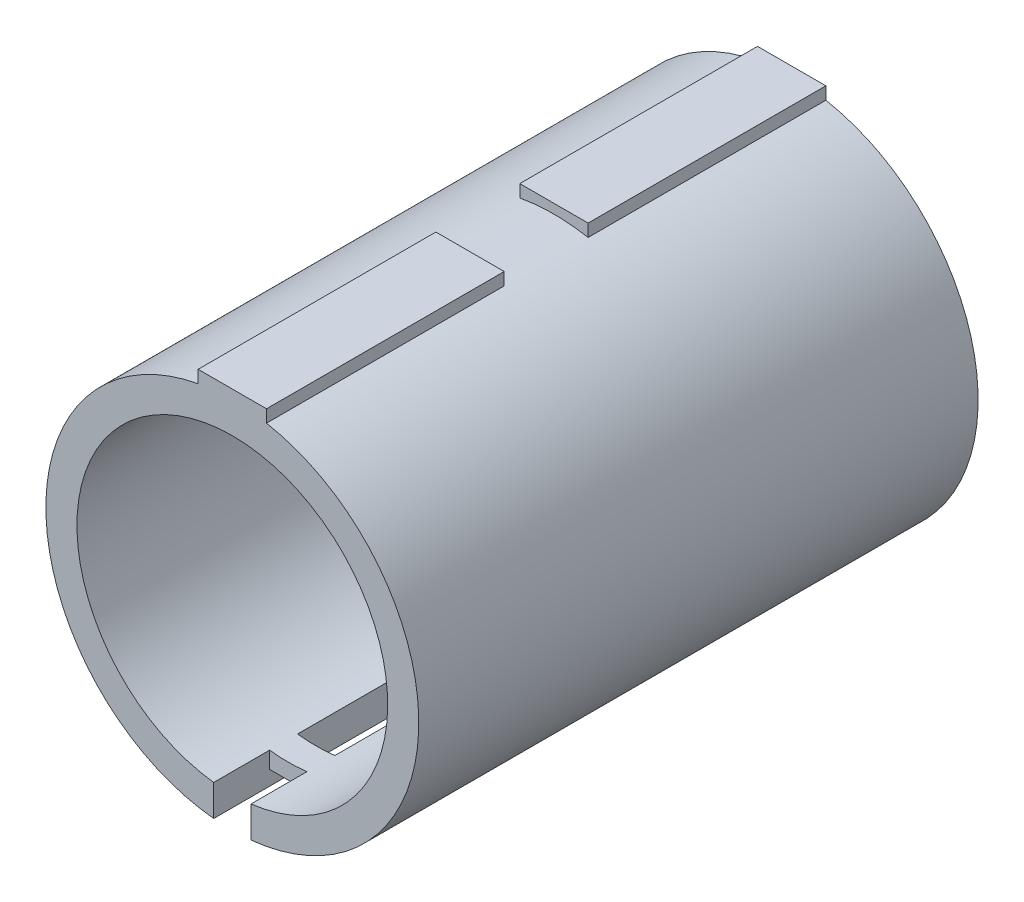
ISO-10303-21;
HEADER;
FILE_DESCRIPTION(('STEP AP214'),'2;1');
FILE_NAME('part.step','',(''),(''),'','','');
FILE_SCHEMA(('AUTOMOTIVE_DESIGN { 1 0 10303 214 1 1 1 1 }'));
ENDSEC;
DATA;
#1=APPLICATION_CONTEXT('core data for automotive mechanical design processes');
#2=APPLICATION_PROTOCOL_DEFINITION('international standard','automotive_design',2000,#1);
#3=PRODUCT_CONTEXT('',#1,'mechanical');
#4=PRODUCT('Part','Part','',(#3));
#5=PRODUCT_RELATED_PRODUCT_CATEGORY('part','',(#4));
#6=PRODUCT_DEFINITION_FORMATION('','',#4);
#7=PRODUCT_DEFINITION_CONTEXT('part definition',#1,'design');
#8=PRODUCT_DEFINITION('design','',#6,#7);
#9=PRODUCT_DEFINITION_SHAPE('','',#8);
#10=(LENGTH_UNIT() NAMED_UNIT(*) SI_UNIT(.MILLI.,.METRE.));
#11=(NAMED_UNIT(*) PLANE_ANGLE_UNIT() SI_UNIT($,.RADIAN.));
#12=(NAMED_UNIT(*) SI_UNIT($,.STERADIAN.) SOLID_ANGLE_UNIT());
#13=UNCERTAINTY_MEASURE_WITH_UNIT(LENGTH_MEASURE(1.E-05),#10,'distance_accuracy_value','');
#14=(GEOMETRIC_REPRESENTATION_CONTEXT(3) GLOBAL_UNCERTAINTY_ASSIGNED_CONTEXT((#13)) GLOBAL_UNIT_ASSIGNED_CONTEXT((#10,
#11,#12)) REPRESENTATION_CONTEXT('',''));
#15=CARTESIAN_POINT('',(0.,0.,0.));
#16=DIRECTION('',(0.,0.,1.));
#17=DIRECTION('',(1.,0.,0.));
#18=AXIS2_PLACEMENT_3D('',#15,#16,#17);
#19=CARTESIAN_POINT('',(3.29597460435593E-13,0.,22.5));
#20=DIRECTION('',(0.,0.,-1.));
#21=DIRECTION('',(0.,1.,0.));
#22=AXIS2_PLACEMENT_3D('',#19,#20,#21);
#23=CYLINDRICAL_SURFACE('',#22,14.9999999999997);
#24=DIRECTION('',(0.,0.,-1.));
#25=VECTOR('',#24,1.);
#26=CARTESIAN_POINT('',(2.75,14.7457621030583,22.5));
#27=LINE('',#26,#25);
#28=CARTESIAN_POINT('',(2.75,14.7457621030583,-3.375));
#29=VERTEX_POINT('',#28);
#30=CARTESIAN_POINT('',(2.75,14.7457621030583,-22.5));
#31=VERTEX_POINT('',#30);
#32=EDGE_CURVE('E184',#29,#31,#27,.T.);
#33=ORIENTED_EDGE('',*,*,#32,.F.);
#34=CARTESIAN_POINT('',(3.29597460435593E-13,0.,-3.375));
#35=DIRECTION('',(0.,0.,1.));
#36=DIRECTION('',(0.0999999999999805,0.994987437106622,0.));
#37=AXIS2_PLACEMENT_3D('',#34,#35,#36);
#38=CIRCLE('',#37,14.9999999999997);
#39=CARTESIAN_POINT('',(-2.75,14.7457621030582,-3.375));
#40=VERTEX_POINT('',#39);
#41=EDGE_CURVE('E32',#29,#40,#38,.T.);
#42=ORIENTED_EDGE('',*,*,#41,.T.);
#43=DIRECTION('',(0.,0.,-1.));
#44=VECTOR('',#43,1.);
#45=CARTESIAN_POINT('',(-2.75,14.7457621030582,22.5));
#46=LINE('',#45,#44);
#47=CARTESIAN_POINT('',(-2.75,14.7457621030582,-22.5));
#48=VERTEX_POINT('',#47);
#49=EDGE_CURVE('E180',#40,#48,#46,.T.);
#50=ORIENTED_EDGE('',*,*,#49,.T.);
#51=CARTESIAN_POINT('',(3.29597460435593E-13,0.,-22.5));
#52=DIRECTION('',(0.,0.,1.));
#53=DIRECTION('',(-0.100000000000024,0.994987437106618,0.));
#54=AXIS2_PLACEMENT_3D('',#51,#52,#53);
#55=CIRCLE('',#54,14.9999999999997);
#56=CARTESIAN_POINT('',(-1.5,-14.9248115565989,-22.5));
#57=VERTEX_POINT('',#56);
#58=EDGE_CURVE('E18',#48,#57,#55,.T.);
#59=ORIENTED_EDGE('',*,*,#58,.T.);
#60=DIRECTION('',(0.,0.,-1.));
#61=VECTOR('',#60,1.);
#62=CARTESIAN_POINT('',(-1.5,-14.924811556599,22.5));
#63=LINE('',#62,#61);
#64=CARTESIAN_POINT('',(-1.5,-14.924811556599,22.5));
#65=VERTEX_POINT('',#64);
#66=EDGE_CURVE('E248',#65,#57,#63,.T.);
#67=ORIENTED_EDGE('',*,*,#66,.F.);
#68=CARTESIAN_POINT('',(3.29597460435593E-13,0.,22.5));
#69=DIRECTION('',(0.,0.,-1.));
#70=DIRECTION('',(-0.100000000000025,-0.994987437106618,0.));
#71=AXIS2_PLACEMENT_3D('',#68,#69,#70);
#72=CIRCLE('',#71,14.9999999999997);
#73=CARTESIAN_POINT('',(-2.75,14.7457621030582,22.5));
#74=VERTEX_POINT('',#73);
#75=EDGE_CURVE('E345',#74,#65,#72,.F.);
#76=ORIENTED_EDGE('',*,*,#75,.F.);
#77=DIRECTION('',(0.,0.,-1.));
#78=VECTOR('',#77,1.);
#79=CARTESIAN_POINT('',(-2.75,14.7457621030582,22.5));
#80=LINE('',#79,#78);
#81=CARTESIAN_POINT('',(-2.75,14.7457621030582,3.375));
#82=VERTEX_POINT('',#81);
#83=EDGE_CURVE('E197',#74,#82,#80,.T.);
#84=ORIENTED_EDGE('',*,*,#83,.T.);
#85=CARTESIAN_POINT('',(3.29597460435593E-13,0.,3.375));
#86=DIRECTION('',(0.,0.,-1.));
#87=DIRECTION('',(-0.100000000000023,0.994987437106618,0.));
#88=AXIS2_PLACEMENT_3D('',#85,#86,#87);
#89=CIRCLE('',#88,14.9999999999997);
#90=CARTESIAN_POINT('',(2.75,14.7457621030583,3.375));
#91=VERTEX_POINT('',#90);
#92=EDGE_CURVE('E343',#91,#82,#89,.F.);
#93=ORIENTED_EDGE('',*,*,#92,.F.);
#94=DIRECTION('',(0.,0.,-1.));
#95=VECTOR('',#94,1.);
#96=CARTESIAN_POINT('',(2.75,14.7457621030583,22.5));
#97=LINE('',#96,#95);
#98=CARTESIAN_POINT('',(2.75,14.7457621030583,22.5));
#99=VERTEX_POINT('',#98);
#100=EDGE_CURVE('E161',#99,#91,#97,.T.);
#101=ORIENTED_EDGE('',*,*,#100,.F.);
#102=CARTESIAN_POINT('',(3.29597460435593E-13,0.,22.5));
#103=DIRECTION('',(0.,0.,-1.));
#104=DIRECTION('',(0.0999999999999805,0.994987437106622,0.));
#105=AXIS2_PLACEMENT_3D('',#102,#103,#104);
#106=CIRCLE('',#105,14.9999999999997);
#107=CARTESIAN_POINT('',(1.5,-14.924811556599,22.5));
#108=VERTEX_POINT('',#107);
#109=EDGE_CURVE('E326',#108,#99,#106,.F.);
#110=ORIENTED_EDGE('',*,*,#109,.F.);
#111=DIRECTION('',(0.,0.,1.));
#112=VECTOR('',#111,1.);
#113=CARTESIAN_POINT('',(1.5,-14.924811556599,-22.5));
#114=LINE('',#113,#112);
#115=CARTESIAN_POINT('',(1.5,-14.924811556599,-22.5));
#116=VERTEX_POINT('',#115);
#117=EDGE_CURVE('E297',#108,#116,#114,.F.);
#118=ORIENTED_EDGE('',*,*,#117,.T.);
#119=CARTESIAN_POINT('',(3.29597460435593E-13,0.,-22.5));
#120=DIRECTION('',(0.,0.,1.));
#121=DIRECTION('',(0.09999999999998,-0.994987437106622,0.));
#122=AXIS2_PLACEMENT_3D('',#119,#120,#121);
#123=CIRCLE('',#122,14.9999999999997);
#124=EDGE_CURVE('E331',#116,#31,#123,.T.);
#125=ORIENTED_EDGE('',*,*,#124,.T.);
#126=EDGE_LOOP('',(#33,#42,#50,#59,#67,#76,#84,#93,#101,#110,#118,#125));
#127=FACE_BOUND('',#126,.T.);
#128=ADVANCED_FACE('F14',(#127),#23,.T.);
#129=CARTESIAN_POINT('',(-1.5,15.75,-3.375));
#130=DIRECTION('',(0.,1.,0.));
#131=DIRECTION('',(1.,0.,0.));
#132=AXIS2_PLACEMENT_3D('',#129,#130,#131);
#133=PLANE('',#132);
#134=DIRECTION('',(1.,0.,0.));
#135=VECTOR('',#134,1.);
#136=CARTESIAN_POINT('',(-1.5,15.75,-3.375));
#137=LINE('',#136,#135);
#138=CARTESIAN_POINT('',(2.75,15.75,-3.375));
#139=VERTEX_POINT('',#138);
#140=CARTESIAN_POINT('',(-2.75,15.75,-3.375));
#141=VERTEX_POINT('',#140);
#142=EDGE_CURVE('E153',#139,#141,#137,.F.);
#143=ORIENTED_EDGE('',*,*,#142,.F.);
#144=DIRECTION('',(0.,0.,1.));
#145=VECTOR('',#144,1.);
#146=CARTESIAN_POINT('',(2.75,15.75,-3.375));
#147=LINE('',#146,#145);
#148=CARTESIAN_POINT('',(2.75,15.75,-22.5));
#149=VERTEX_POINT('',#148);
#150=EDGE_CURVE('E156',#149,#139,#147,.T.);
#151=ORIENTED_EDGE('',*,*,#150,.F.);
#152=DIRECTION('',(-1.,0.,0.));
#153=VECTOR('',#152,1.);
#154=CARTESIAN_POINT('',(1.5,15.75,-22.5));
#155=LINE('',#154,#153);
#156=CARTESIAN_POINT('',(-2.75,15.75,-22.5));
#157=VERTEX_POINT('',#156);
#158=EDGE_CURVE('E160',#149,#157,#155,.T.);
#159=ORIENTED_EDGE('',*,*,#158,.T.);
#160=DIRECTION('',(0.,0.,1.));
#161=VECTOR('',#160,1.);
#162=CARTESIAN_POINT('',(-2.75,15.75,-3.375));
#163=LINE('',#162,#161);
#164=EDGE_CURVE('E158',#157,#141,#163,.T.);
#165=ORIENTED_EDGE('',*,*,#164,.T.);
#166=EDGE_LOOP('',(#143,#151,#159,#165));
#167=FACE_BOUND('',#166,.T.);
#168=ADVANCED_FACE('F154',(#167),#133,.T.);
#169=CARTESIAN_POINT('',(-1.5,-14.924811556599,-22.5));
#170=DIRECTION('',(1.,0.,0.));
#171=DIRECTION('',(0.,1.,0.));
#172=AXIS2_PLACEMENT_3D('',#169,#170,#171);
#173=PLANE('',#172);
#174=DIRECTION('',(0.,0.,1.));
#175=VECTOR('',#174,1.);
#176=CARTESIAN_POINT('',(-1.5,-13.75,-18.));
#177=LINE('',#176,#175);
#178=CARTESIAN_POINT('',(-1.5,-13.75,-15.75));
#179=VERTEX_POINT('',#178);
#180=CARTESIAN_POINT('',(-1.5,-13.75,-18.));
#181=VERTEX_POINT('',#180);
#182=EDGE_CURVE('E212',#179,#181,#177,.F.);
#183=ORIENTED_EDGE('',*,*,#182,.F.);
#184=DIRECTION('',(0.,1.,0.));
#185=VECTOR('',#184,1.);
#186=CARTESIAN_POINT('',(-1.5,-13.75,-15.75));
#187=LINE('',#186,#185);
#188=CARTESIAN_POINT('',(-1.5,-12.409673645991,-15.75));
#189=VERTEX_POINT('',#188);
#190=EDGE_CURVE('E217',#189,#179,#187,.F.);
#191=ORIENTED_EDGE('',*,*,#190,.F.);
#192=DIRECTION('',(0.,0.,1.));
#193=VECTOR('',#192,1.);
#194=CARTESIAN_POINT('',(-1.5,-12.409673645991,-15.75));
#195=LINE('',#194,#193);
#196=CARTESIAN_POINT('',(-1.5,-12.4096736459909,15.75));
#197=VERTEX_POINT('',#196);
#198=EDGE_CURVE('E221',#197,#189,#195,.F.);
#199=ORIENTED_EDGE('',*,*,#198,.F.);
#200=DIRECTION('',(0.,-1.,0.));
#201=VECTOR('',#200,1.);
#202=CARTESIAN_POINT('',(-1.5,-12.4096736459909,15.75));
#203=LINE('',#202,#201);
#204=CARTESIAN_POINT('',(-1.5,-13.75,15.75));
#205=VERTEX_POINT('',#204);
#206=EDGE_CURVE('E225',#197,#205,#203,.T.);
#207=ORIENTED_EDGE('',*,*,#206,.T.);
#208=DIRECTION('',(0.,0.,1.));
#209=VECTOR('',#208,1.);
#210=CARTESIAN_POINT('',(-1.5,-13.75,15.75));
#211=LINE('',#210,#209);
#212=CARTESIAN_POINT('',(-1.5,-13.75,18.));
#213=VERTEX_POINT('',#212);
#214=EDGE_CURVE('E230',#205,#213,#211,.T.);
#215=ORIENTED_EDGE('',*,*,#214,.T.);
#216=DIRECTION('',(0.,1.,0.));
#217=VECTOR('',#216,1.);
#218=CARTESIAN_POINT('',(-1.5,-13.75,18.));
#219=LINE('',#218,#217);
#220=CARTESIAN_POINT('',(-1.5,-12.409673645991,18.));
#221=VERTEX_POINT('',#220);
#222=EDGE_CURVE('E235',#221,#213,#219,.F.);
#223=ORIENTED_EDGE('',*,*,#222,.F.);
#224=DIRECTION('',(0.,0.,1.));
#225=VECTOR('',#224,1.);
#226=CARTESIAN_POINT('',(-1.5,-12.409673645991,18.));
#227=LINE('',#226,#225);
#228=CARTESIAN_POINT('',(-1.5,-12.4096736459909,22.5));
#229=VERTEX_POINT('',#228);
#230=EDGE_CURVE('E239',#229,#221,#227,.F.);
#231=ORIENTED_EDGE('',*,*,#230,.F.);
#232=DIRECTION('',(0.,-1.,0.));
#233=VECTOR('',#232,1.);
#234=CARTESIAN_POINT('',(-1.5,-12.4096736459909,22.5));
#235=LINE('',#234,#233);
#236=EDGE_CURVE('E243',#65,#229,#235,.F.);
#237=ORIENTED_EDGE('',*,*,#236,.F.);
#238=ORIENTED_EDGE('',*,*,#66,.T.);
#239=DIRECTION('',(0.,1.,0.));
#240=VECTOR('',#239,1.);
#241=CARTESIAN_POINT('',(-1.5,-14.9248115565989,-22.5));
#242=LINE('',#241,#240);
#243=CARTESIAN_POINT('',(-1.5,-12.409673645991,-22.5));
#244=VERTEX_POINT('',#243);
#245=EDGE_CURVE('E253',#57,#244,#242,.T.);
#246=ORIENTED_EDGE('',*,*,#245,.T.);
#247=DIRECTION('',(0.,0.,1.));
#248=VECTOR('',#247,1.);
#249=CARTESIAN_POINT('',(-1.5,-12.409673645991,-22.5));
#250=LINE('',#249,#248);
#251=CARTESIAN_POINT('',(-1.5,-12.4096736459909,-18.));
#252=VERTEX_POINT('',#251);
#253=EDGE_CURVE('E258',#252,#244,#250,.F.);
#254=ORIENTED_EDGE('',*,*,#253,.F.);
#255=DIRECTION('',(0.,-1.,0.));
#256=VECTOR('',#255,1.);
#257=CARTESIAN_POINT('',(-1.5,-12.4096736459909,-18.));
#258=LINE('',#257,#256);
#259=EDGE_CURVE('E262',#252,#181,#258,.T.);
#260=ORIENTED_EDGE('',*,*,#259,.T.);
#261=EDGE_LOOP('',(#183,#191,#199,#207,#215,#223,#231,#237,#238,#246,#254,#260));
#262=FACE_BOUND('',#261,.T.);
#263=ADVANCED_FACE('F415',(#262),#173,.T.);
#264=CARTESIAN_POINT('',(1.5,-14.924811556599,22.5));
#265=DIRECTION('',(-1.,0.,0.));
#266=DIRECTION('',(0.,1.,0.));
#267=AXIS2_PLACEMENT_3D('',#264,#265,#266);
#268=PLANE('',#267);
#269=DIRECTION('',(0.,0.,-1.));
#270=VECTOR('',#269,1.);
#271=CARTESIAN_POINT('',(1.5,-12.409673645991,15.75));
#272=LINE('',#271,#270);
#273=CARTESIAN_POINT('',(1.5,-12.409673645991,15.75));
#274=VERTEX_POINT('',#273);
#275=CARTESIAN_POINT('',(1.5,-12.4096736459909,-15.75));
#276=VERTEX_POINT('',#275);
#277=EDGE_CURVE('E267',#274,#276,#272,.T.);
#278=ORIENTED_EDGE('',*,*,#277,.T.);
#279=DIRECTION('',(0.,-1.,0.));
#280=VECTOR('',#279,1.);
#281=CARTESIAN_POINT('',(1.5,-12.4096736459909,-15.75));
#282=LINE('',#281,#280);
#283=CARTESIAN_POINT('',(1.5,-13.75,-15.75));
#284=VERTEX_POINT('',#283);
#285=EDGE_CURVE('E272',#284,#276,#282,.F.);
#286=ORIENTED_EDGE('',*,*,#285,.F.);
#287=DIRECTION('',(0.,0.,-1.));
#288=VECTOR('',#287,1.);
#289=CARTESIAN_POINT('',(1.5,-13.75,-15.75));
#290=LINE('',#289,#288);
#291=CARTESIAN_POINT('',(1.5,-13.75,-18.));
#292=VERTEX_POINT('',#291);
#293=EDGE_CURVE('E277',#284,#292,#290,.T.);
#294=ORIENTED_EDGE('',*,*,#293,.T.);
#295=DIRECTION('',(0.,1.,0.));
#296=VECTOR('',#295,1.);
#297=CARTESIAN_POINT('',(1.5,-13.75,-18.));
#298=LINE('',#297,#296);
#299=CARTESIAN_POINT('',(1.5,-12.409673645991,-18.));
#300=VERTEX_POINT('',#299);
#301=EDGE_CURVE('E282',#292,#300,#298,.T.);
#302=ORIENTED_EDGE('',*,*,#301,.T.);
#303=DIRECTION('',(0.,0.,-1.));
#304=VECTOR('',#303,1.);
#305=CARTESIAN_POINT('',(1.5,-12.409673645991,-18.));
#306=LINE('',#305,#304);
#307=CARTESIAN_POINT('',(1.5,-12.4096736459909,-22.5));
#308=VERTEX_POINT('',#307);
#309=EDGE_CURVE('E287',#300,#308,#306,.T.);
#310=ORIENTED_EDGE('',*,*,#309,.T.);
#311=DIRECTION('',(0.,-1.,0.));
#312=VECTOR('',#311,1.);
#313=CARTESIAN_POINT('',(1.5,-12.4096736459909,-22.5));
#314=LINE('',#313,#312);
#315=EDGE_CURVE('E292',#308,#116,#314,.T.);
#316=ORIENTED_EDGE('',*,*,#315,.T.);
#317=ORIENTED_EDGE('',*,*,#117,.F.);
#318=DIRECTION('',(0.,1.,0.));
#319=VECTOR('',#318,1.);
#320=CARTESIAN_POINT('',(1.5,-14.924811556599,22.5));
#321=LINE('',#320,#319);
#322=CARTESIAN_POINT('',(1.5,-12.409673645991,22.5));
#323=VERTEX_POINT('',#322);
#324=EDGE_CURVE('E302',#323,#108,#321,.F.);
#325=ORIENTED_EDGE('',*,*,#324,.F.);
#326=DIRECTION('',(0.,0.,-1.));
#327=VECTOR('',#326,1.);
#328=CARTESIAN_POINT('',(1.5,-12.409673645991,22.5));
#329=LINE('',#328,#327);
#330=CARTESIAN_POINT('',(1.5,-12.4096736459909,18.));
#331=VERTEX_POINT('',#330);
#332=EDGE_CURVE('E306',#323,#331,#329,.T.);
#333=ORIENTED_EDGE('',*,*,#332,.T.);
#334=DIRECTION('',(0.,-1.,0.));
#335=VECTOR('',#334,1.);
#336=CARTESIAN_POINT('',(1.5,-12.4096736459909,18.));
#337=LINE('',#336,#335);
#338=CARTESIAN_POINT('',(1.5,-13.75,18.));
#339=VERTEX_POINT('',#338);
#340=EDGE_CURVE('E311',#339,#331,#337,.F.);
#341=ORIENTED_EDGE('',*,*,#340,.F.);
#342=DIRECTION('',(0.,0.,-1.));
#343=VECTOR('',#342,1.);
#344=CARTESIAN_POINT('',(1.5,-13.75,18.));
#345=LINE('',#344,#343);
#346=CARTESIAN_POINT('',(1.5,-13.75,15.75));
#347=VERTEX_POINT('',#346);
#348=EDGE_CURVE('E316',#347,#339,#345,.F.);
#349=ORIENTED_EDGE('',*,*,#348,.F.);
#350=DIRECTION('',(0.,1.,0.));
#351=VECTOR('',#350,1.);
#352=CARTESIAN_POINT('',(1.5,-13.75,15.75));
#353=LINE('',#352,#351);
#354=EDGE_CURVE('E321',#347,#274,#353,.T.);
#355=ORIENTED_EDGE('',*,*,#354,.T.);
#356=EDGE_LOOP('',(#278,#286,#294,#302,#310,#316,#317,#325,#333,#341,#349,#355));
#357=FACE_BOUND('',#356,.T.);
#358=ADVANCED_FACE('F425',(#357),#268,.T.);
#359=CARTESIAN_POINT('',(-1.5,15.75,22.5));
#360=DIRECTION('',(0.,1.,0.));
#361=DIRECTION('',(1.,0.,0.));
#362=AXIS2_PLACEMENT_3D('',#359,#360,#361);
#363=PLANE('',#362);
#364=DIRECTION('',(1.,0.,0.));
#365=VECTOR('',#364,1.);
#366=CARTESIAN_POINT('',(-1.5,15.75,22.5));
#367=LINE('',#366,#365);
#368=CARTESIAN_POINT('',(2.75,15.75,22.5));
#369=VERTEX_POINT('',#368);
#370=CARTESIAN_POINT('',(-2.75,15.75,22.5));
#371=VERTEX_POINT('',#370);
#372=EDGE_CURVE('E388',#369,#371,#367,.F.);
#373=ORIENTED_EDGE('',*,*,#372,.F.);
#374=DIRECTION('',(0.,0.,1.));
#375=VECTOR('',#374,1.);
#376=CARTESIAN_POINT('',(2.75,15.75,22.5));
#377=LINE('',#376,#375);
#378=CARTESIAN_POINT('',(2.75,15.75,3.375));
#379=VERTEX_POINT('',#378);
#380=EDGE_CURVE('E187',#379,#369,#377,.T.);
#381=ORIENTED_EDGE('',*,*,#380,.F.);
#382=DIRECTION('',(-1.,0.,0.));
#383=VECTOR('',#382,1.);
#384=CARTESIAN_POINT('',(1.5,15.75,3.375));
#385=LINE('',#384,#383);
#386=CARTESIAN_POINT('',(-2.75,15.75,3.375));
#387=VERTEX_POINT('',#386);
#388=EDGE_CURVE('E392',#379,#387,#385,.T.);
#389=ORIENTED_EDGE('',*,*,#388,.T.);
#390=DIRECTION('',(0.,0.,1.));
#391=VECTOR('',#390,1.);
#392=CARTESIAN_POINT('',(-2.75,15.75,22.5));
#393=LINE('',#392,#391);
#394=EDGE_CURVE('E186',#387,#371,#393,.T.);
#395=ORIENTED_EDGE('',*,*,#394,.T.);
#396=EDGE_LOOP('',(#373,#381,#389,#395));
#397=FACE_BOUND('',#396,.T.);
#398=ADVANCED_FACE('F459',(#397),#363,.T.);
#399=CARTESIAN_POINT('',(-15.3290676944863,-14.924811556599,22.5));
#400=DIRECTION('',(0.,0.,1.));
#401=DIRECTION('',(1.,0.,0.));
#402=AXIS2_PLACEMENT_3D('',#399,#400,#401);
#403=PLANE('',#402);
#404=ORIENTED_EDGE('',*,*,#109,.T.);
#405=DIRECTION('',(0.,-1.,0.));
#406=VECTOR('',#405,1.);
#407=CARTESIAN_POINT('',(2.75,14.2499999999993,22.5));
#408=LINE('',#407,#406);
#409=EDGE_CURVE('E190',#369,#99,#408,.T.);
#410=ORIENTED_EDGE('',*,*,#409,.F.);
#411=ORIENTED_EDGE('',*,*,#372,.T.);
#412=DIRECTION('',(0.,-1.,0.));
#413=VECTOR('',#412,1.);
#414=CARTESIAN_POINT('',(-2.75,14.2499999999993,22.5));
#415=LINE('',#414,#413);
#416=EDGE_CURVE('E200',#371,#74,#415,.T.);
#417=ORIENTED_EDGE('',*,*,#416,.T.);
#418=ORIENTED_EDGE('',*,*,#75,.T.);
#419=ORIENTED_EDGE('',*,*,#236,.T.);
#420=CARTESIAN_POINT('',(0.,0.,22.5));
#421=DIRECTION('',(0.,0.,-1.));
#422=DIRECTION('',(1.,0.,0.));
#423=AXIS2_PLACEMENT_3D('',#420,#421,#422);
#424=CIRCLE('',#423,12.5);
#425=EDGE_CURVE('E384',#323,#229,#424,.F.);
#426=ORIENTED_EDGE('',*,*,#425,.F.);
#427=ORIENTED_EDGE('',*,*,#324,.T.);
#428=EDGE_LOOP('',(#404,#410,#411,#417,#418,#419,#426,#427));
#429=FACE_BOUND('',#428,.T.);
#430=ADVANCED_FACE('F410',(#429),#403,.T.);
#431=CARTESIAN_POINT('',(-15.3290676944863,-14.924811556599,-22.5));
#432=DIRECTION('',(0.,0.,-1.));
#433=DIRECTION('',(0.,1.,0.));
#434=AXIS2_PLACEMENT_3D('',#431,#432,#433);
#435=PLANE('',#434);
#436=ORIENTED_EDGE('',*,*,#58,.F.);
#437=DIRECTION('',(0.,1.,0.));
#438=VECTOR('',#437,1.);
#439=CARTESIAN_POINT('',(-2.75,14.2499999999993,-22.5));
#440=LINE('',#439,#438);
#441=EDGE_CURVE('E173',#48,#157,#440,.T.);
#442=ORIENTED_EDGE('',*,*,#441,.T.);
#443=ORIENTED_EDGE('',*,*,#158,.F.);
#444=DIRECTION('',(0.,1.,0.));
#445=VECTOR('',#444,1.);
#446=CARTESIAN_POINT('',(2.75,14.2499999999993,-22.5));
#447=LINE('',#446,#445);
#448=EDGE_CURVE('E168',#31,#149,#447,.T.);
#449=ORIENTED_EDGE('',*,*,#448,.F.);
#450=ORIENTED_EDGE('',*,*,#124,.F.);
#451=ORIENTED_EDGE('',*,*,#315,.F.);
#452=CARTESIAN_POINT('',(0.,0.,-22.5));
#453=DIRECTION('',(0.,0.,1.));
#454=DIRECTION('',(-1.,-5.25445373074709E-09,0.));
#455=AXIS2_PLACEMENT_3D('',#452,#453,#454);
#456=CIRCLE('',#455,12.5);
#457=EDGE_CURVE('E379',#308,#244,#456,.T.);
#458=ORIENTED_EDGE('',*,*,#457,.T.);
#459=ORIENTED_EDGE('',*,*,#245,.F.);
#460=EDGE_LOOP('',(#436,#442,#443,#449,#450,#451,#458,#459));
#461=FACE_BOUND('',#460,.T.);
#462=ADVANCED_FACE('F453',(#461),#435,.T.);
#463=CARTESIAN_POINT('',(-1.5,-13.75,18.));
#464=DIRECTION('',(0.,-1.,0.));
#465=DIRECTION('',(0.,0.,-1.));
#466=AXIS2_PLACEMENT_3D('',#463,#464,#465);
#467=PLANE('',#466);
#468=DIRECTION('',(-1.,0.,0.));
#469=VECTOR('',#468,1.);
#470=CARTESIAN_POINT('',(1.5,-13.75,18.));
#471=LINE('',#470,#469);
#472=EDGE_CURVE('E375',#213,#339,#471,.F.);
#473=ORIENTED_EDGE('',*,*,#472,.F.);
#474=ORIENTED_EDGE('',*,*,#214,.F.);
#475=DIRECTION('',(1.,0.,0.));
#476=VECTOR('',#475,1.);
#477=CARTESIAN_POINT('',(-1.5,-13.75,15.75));
#478=LINE('',#477,#476);
#479=EDGE_CURVE('E370',#205,#347,#478,.T.);
#480=ORIENTED_EDGE('',*,*,#479,.T.);
#481=ORIENTED_EDGE('',*,*,#348,.T.);
#482=EDGE_LOOP('',(#473,#474,#480,#481));
#483=FACE_BOUND('',#482,.T.);
#484=ADVANCED_FACE('F428',(#483),#467,.T.);
#485=CARTESIAN_POINT('',(-1.5,-13.75,15.75));
#486=DIRECTION('',(0.,0.,-1.));
#487=DIRECTION('',(0.,1.,0.));
#488=AXIS2_PLACEMENT_3D('',#485,#486,#487);
#489=PLANE('',#488);
#490=CARTESIAN_POINT('',(0.,0.,15.75));
#491=DIRECTION('',(0.,0.,1.));
#492=DIRECTION('',(-0.12,-0.992773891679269,0.));
#493=AXIS2_PLACEMENT_3D('',#490,#491,#492);
#494=CIRCLE('',#493,12.5);
#495=EDGE_CURVE('E365',#197,#274,#494,.T.);
#496=ORIENTED_EDGE('',*,*,#495,.T.);
#497=ORIENTED_EDGE('',*,*,#354,.F.);
#498=ORIENTED_EDGE('',*,*,#479,.F.);
#499=ORIENTED_EDGE('',*,*,#206,.F.);
#500=EDGE_LOOP('',(#496,#497,#498,#499));
#501=FACE_BOUND('',#500,.T.);
#502=ADVANCED_FACE('F432',(#501),#489,.T.);
#503=CARTESIAN_POINT('',(-1.5,-13.75,18.));
#504=DIRECTION('',(0.,0.,1.));
#505=DIRECTION('',(1.,0.,0.));
#506=AXIS2_PLACEMENT_3D('',#503,#504,#505);
#507=PLANE('',#506);
#508=CARTESIAN_POINT('',(0.,0.,18.));
#509=DIRECTION('',(0.,0.,-1.));
#510=DIRECTION('',(0.12,-0.992773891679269,0.));
#511=AXIS2_PLACEMENT_3D('',#508,#509,#510);
#512=CIRCLE('',#511,12.5);
#513=EDGE_CURVE('E361',#221,#331,#512,.F.);
#514=ORIENTED_EDGE('',*,*,#513,.F.);
#515=ORIENTED_EDGE('',*,*,#222,.T.);
#516=ORIENTED_EDGE('',*,*,#472,.T.);
#517=ORIENTED_EDGE('',*,*,#340,.T.);
#518=EDGE_LOOP('',(#514,#515,#516,#517));
#519=FACE_BOUND('',#518,.T.);
#520=ADVANCED_FACE('F420',(#519),#507,.T.);
#521=CARTESIAN_POINT('',(-1.5,-13.75,-18.));
#522=DIRECTION('',(0.,-1.,0.));
#523=DIRECTION('',(1.,0.,0.));
#524=AXIS2_PLACEMENT_3D('',#521,#522,#523);
#525=PLANE('',#524);
#526=DIRECTION('',(1.,0.,0.));
#527=VECTOR('',#526,1.);
#528=CARTESIAN_POINT('',(-1.5,-13.75,-18.));
#529=LINE('',#528,#527);
#530=EDGE_CURVE('E356',#181,#292,#529,.T.);
#531=ORIENTED_EDGE('',*,*,#530,.T.);
#532=ORIENTED_EDGE('',*,*,#293,.F.);
#533=DIRECTION('',(-1.,0.,0.));
#534=VECTOR('',#533,1.);
#535=CARTESIAN_POINT('',(1.5,-13.75,-15.75));
#536=LINE('',#535,#534);
#537=EDGE_CURVE('E352',#179,#284,#536,.F.);
#538=ORIENTED_EDGE('',*,*,#537,.F.);
#539=ORIENTED_EDGE('',*,*,#182,.T.);
#540=EDGE_LOOP('',(#531,#532,#538,#539));
#541=FACE_BOUND('',#540,.T.);
#542=ADVANCED_FACE('F443',(#541),#525,.T.);
#543=CARTESIAN_POINT('',(-1.5,-13.75,-15.75));
#544=DIRECTION('',(0.,0.,1.));
#545=DIRECTION('',(1.,0.,0.));
#546=AXIS2_PLACEMENT_3D('',#543,#544,#545);
#547=PLANE('',#546);
#548=CARTESIAN_POINT('',(0.,0.,-15.75));
#549=DIRECTION('',(0.,0.,-1.));
#550=DIRECTION('',(0.12,-0.992773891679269,0.));
#551=AXIS2_PLACEMENT_3D('',#548,#549,#550);
#552=CIRCLE('',#551,12.5);
#553=EDGE_CURVE('E24',#189,#276,#552,.F.);
#554=ORIENTED_EDGE('',*,*,#553,.F.);
#555=ORIENTED_EDGE('',*,*,#190,.T.);
#556=ORIENTED_EDGE('',*,*,#537,.T.);
#557=ORIENTED_EDGE('',*,*,#285,.T.);
#558=EDGE_LOOP('',(#554,#555,#556,#557));
#559=FACE_BOUND('',#558,.T.);
#560=ADVANCED_FACE('F438',(#559),#547,.T.);
#561=CARTESIAN_POINT('',(-1.5,-13.75,-18.));
#562=DIRECTION('',(0.,0.,-1.));
#563=DIRECTION('',(0.,1.,0.));
#564=AXIS2_PLACEMENT_3D('',#561,#562,#563);
#565=PLANE('',#564);
#566=CARTESIAN_POINT('',(0.,0.,-18.));
#567=DIRECTION('',(0.,0.,1.));
#568=DIRECTION('',(-0.12,-0.992773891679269,0.));
#569=AXIS2_PLACEMENT_3D('',#566,#567,#568);
#570=CIRCLE('',#569,12.5);
#571=EDGE_CURVE('E9',#252,#300,#570,.T.);
#572=ORIENTED_EDGE('',*,*,#571,.T.);
#573=ORIENTED_EDGE('',*,*,#301,.F.);
#574=ORIENTED_EDGE('',*,*,#530,.F.);
#575=ORIENTED_EDGE('',*,*,#259,.F.);
#576=EDGE_LOOP('',(#572,#573,#574,#575));
#577=FACE_BOUND('',#576,.T.);
#578=ADVANCED_FACE('F446',(#577),#565,.T.);
#579=CARTESIAN_POINT('',(-1.5,14.924811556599,3.375));
#580=DIRECTION('',(0.,0.,-1.));
#581=DIRECTION('',(0.,1.,0.));
#582=AXIS2_PLACEMENT_3D('',#579,#580,#581);
#583=PLANE('',#582);
#584=ORIENTED_EDGE('',*,*,#388,.F.);
#585=DIRECTION('',(0.,1.,0.));
#586=VECTOR('',#585,1.);
#587=CARTESIAN_POINT('',(2.75,14.2499999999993,3.375));
#588=LINE('',#587,#586);
#589=EDGE_CURVE('E194',#91,#379,#588,.T.);
#590=ORIENTED_EDGE('',*,*,#589,.F.);
#591=ORIENTED_EDGE('',*,*,#92,.T.);
#592=DIRECTION('',(0.,1.,0.));
#593=VECTOR('',#592,1.);
#594=CARTESIAN_POINT('',(-2.75,14.2499999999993,3.375));
#595=LINE('',#594,#593);
#596=EDGE_CURVE('E191',#82,#387,#595,.T.);
#597=ORIENTED_EDGE('',*,*,#596,.T.);
#598=EDGE_LOOP('',(#584,#590,#591,#597));
#599=FACE_BOUND('',#598,.T.);
#600=ADVANCED_FACE('F401',(#599),#583,.T.);
#601=CARTESIAN_POINT('',(-1.5,14.924811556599,-3.375));
#602=DIRECTION('',(0.,0.,1.));
#603=DIRECTION('',(1.,0.,0.));
#604=AXIS2_PLACEMENT_3D('',#601,#602,#603);
#605=PLANE('',#604);
#606=ORIENTED_EDGE('',*,*,#142,.T.);
#607=DIRECTION('',(0.,-1.,0.));
#608=VECTOR('',#607,1.);
#609=CARTESIAN_POINT('',(-2.75,14.2499999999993,-3.375));
#610=LINE('',#609,#608);
#611=EDGE_CURVE('E176',#141,#40,#610,.T.);
#612=ORIENTED_EDGE('',*,*,#611,.T.);
#613=ORIENTED_EDGE('',*,*,#41,.F.);
#614=DIRECTION('',(0.,-1.,0.));
#615=VECTOR('',#614,1.);
#616=CARTESIAN_POINT('',(2.75,14.2499999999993,-3.375));
#617=LINE('',#616,#615);
#618=EDGE_CURVE('E164',#139,#29,#617,.T.);
#619=ORIENTED_EDGE('',*,*,#618,.F.);
#620=EDGE_LOOP('',(#606,#612,#613,#619));
#621=FACE_BOUND('',#620,.T.);
#622=ADVANCED_FACE('F165',(#621),#605,.T.);
#623=CARTESIAN_POINT('',(0.,0.,22.5));
#624=DIRECTION('',(0.,0.,-1.));
#625=DIRECTION('',(1.,0.,0.));
#626=AXIS2_PLACEMENT_3D('',#623,#624,#625);
#627=CYLINDRICAL_SURFACE('',#626,12.5);
#628=ORIENTED_EDGE('',*,*,#309,.F.);
#629=ORIENTED_EDGE('',*,*,#571,.F.);
#630=ORIENTED_EDGE('',*,*,#253,.T.);
#631=ORIENTED_EDGE('',*,*,#457,.F.);
#632=EDGE_LOOP('',(#628,#629,#630,#631));
#633=FACE_BOUND('',#632,.T.);
#634=ORIENTED_EDGE('',*,*,#553,.T.);
#635=ORIENTED_EDGE('',*,*,#277,.F.);
#636=ORIENTED_EDGE('',*,*,#495,.F.);
#637=ORIENTED_EDGE('',*,*,#198,.T.);
#638=EDGE_LOOP('',(#634,#635,#636,#637));
#639=FACE_BOUND('',#638,.T.);
#640=ORIENTED_EDGE('',*,*,#230,.T.);
#641=ORIENTED_EDGE('',*,*,#513,.T.);
#642=ORIENTED_EDGE('',*,*,#332,.F.);
#643=ORIENTED_EDGE('',*,*,#425,.T.);
#644=EDGE_LOOP('',(#640,#641,#642,#643));
#645=FACE_BOUND('',#644,.T.);
#646=ADVANCED_FACE('F16',(#633,#639,#645),#627,.F.);
#647=CARTESIAN_POINT('',(2.75,0.,0.));
#648=DIRECTION('',(1.,0.,0.));
#649=DIRECTION('',(0.,0.,-1.));
#650=AXIS2_PLACEMENT_3D('',#647,#648,#649);
#651=PLANE('',#650);
#652=ORIENTED_EDGE('',*,*,#409,.T.);
#653=ORIENTED_EDGE('',*,*,#100,.T.);
#654=ORIENTED_EDGE('',*,*,#589,.T.);
#655=ORIENTED_EDGE('',*,*,#380,.T.);
#656=EDGE_LOOP('',(#652,#653,#654,#655));
#657=FACE_BOUND('',#656,.T.);
#658=ADVANCED_FACE('F458',(#657),#651,.T.);
#659=CARTESIAN_POINT('',(-2.75,0.,0.));
#660=DIRECTION('',(1.,0.,0.));
#661=DIRECTION('',(0.,0.,-1.));
#662=AXIS2_PLACEMENT_3D('',#659,#660,#661);
#663=PLANE('',#662);
#664=ORIENTED_EDGE('',*,*,#83,.F.);
#665=ORIENTED_EDGE('',*,*,#416,.F.);
#666=ORIENTED_EDGE('',*,*,#394,.F.);
#667=ORIENTED_EDGE('',*,*,#596,.F.);
#668=EDGE_LOOP('',(#664,#665,#666,#667));
#669=FACE_BOUND('',#668,.T.);
#670=ADVANCED_FACE('F404',(#669),#663,.F.);
#671=CARTESIAN_POINT('',(2.75,0.,0.));
#672=DIRECTION('',(1.,0.,0.));
#673=DIRECTION('',(0.,0.,-1.));
#674=AXIS2_PLACEMENT_3D('',#671,#672,#673);
#675=PLANE('',#674);
#676=ORIENTED_EDGE('',*,*,#618,.T.);
#677=ORIENTED_EDGE('',*,*,#32,.T.);
#678=ORIENTED_EDGE('',*,*,#448,.T.);
#679=ORIENTED_EDGE('',*,*,#150,.T.);
#680=EDGE_LOOP('',(#676,#677,#678,#679));
#681=FACE_BOUND('',#680,.T.);
#682=ADVANCED_FACE('F171',(#681),#675,.T.);
#683=CARTESIAN_POINT('',(-2.75,0.,0.));
#684=DIRECTION('',(1.,0.,0.));
#685=DIRECTION('',(0.,0.,-1.));
#686=AXIS2_PLACEMENT_3D('',#683,#684,#685);
#687=PLANE('',#686);
#688=ORIENTED_EDGE('',*,*,#49,.F.);
#689=ORIENTED_EDGE('',*,*,#611,.F.);
#690=ORIENTED_EDGE('',*,*,#164,.F.);
#691=ORIENTED_EDGE('',*,*,#441,.F.);
#692=EDGE_LOOP('',(#688,#689,#690,#691));
#693=FACE_BOUND('',#692,.T.);
#694=ADVANCED_FACE('F484',(#693),#687,.F.);
#695=CLOSED_SHELL('',(#128,#168,#263,#358,#398,#430,#462,#484,#502,#520,#542,#560,#578,#600,
#622,#646,#658,#670,#682,#694));
#696=MANIFOLD_SOLID_BREP('B1',#695);
#697=ADVANCED_BREP_SHAPE_REPRESENTATION('',(#18,#696),#14);
#698=SHAPE_DEFINITION_REPRESENTATION(#9,#697);
ENDSEC;
END-ISO-10303-21;
